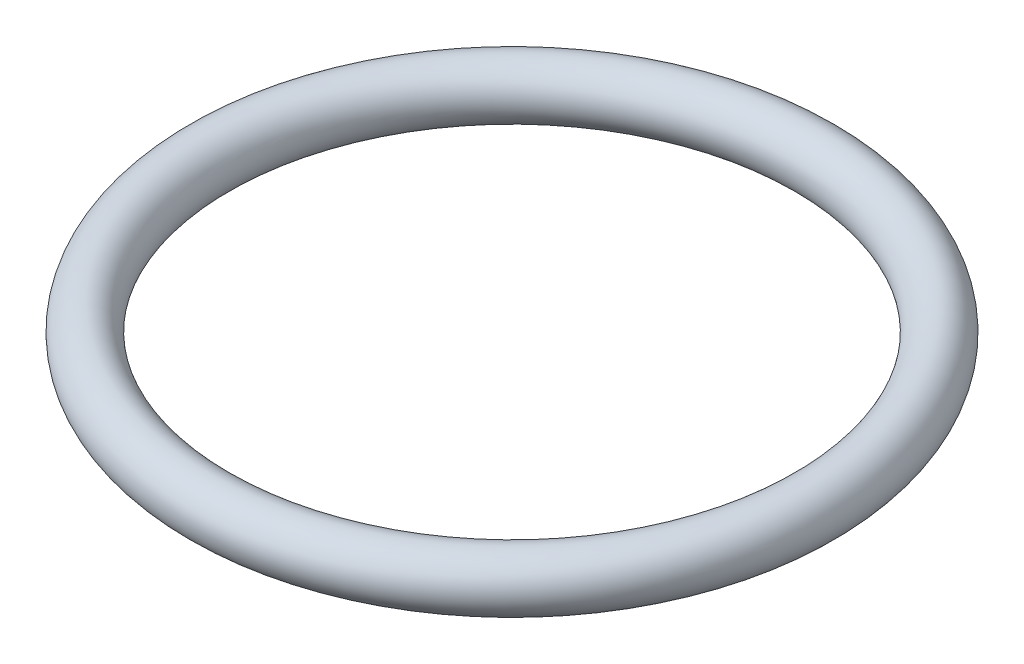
from build123d import *

# Parameters (mm, degrees)
ESQUISSE1_R = 0.5


with BuildPart() as part:
    # Esquisse1 → R_volution1 (revolve)
    with BuildSketch(Plane(origin=(0, 0, 0), x_dir=(0, 0, -1), z_dir=(1, 0, 0)), mode=Mode.PRIVATE) as r_volution1_sk:
        with Locations((5.5, 0.5)):
            Circle(ESQUISSE1_R)
    revolve(r_volution1_sk.sketch.rotate(Axis((0, 35.837558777, 0), (0, -1, 0)), 180), axis=Axis((0, 35.837558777, 0), (0, -1, 0)))


solid = part.part
